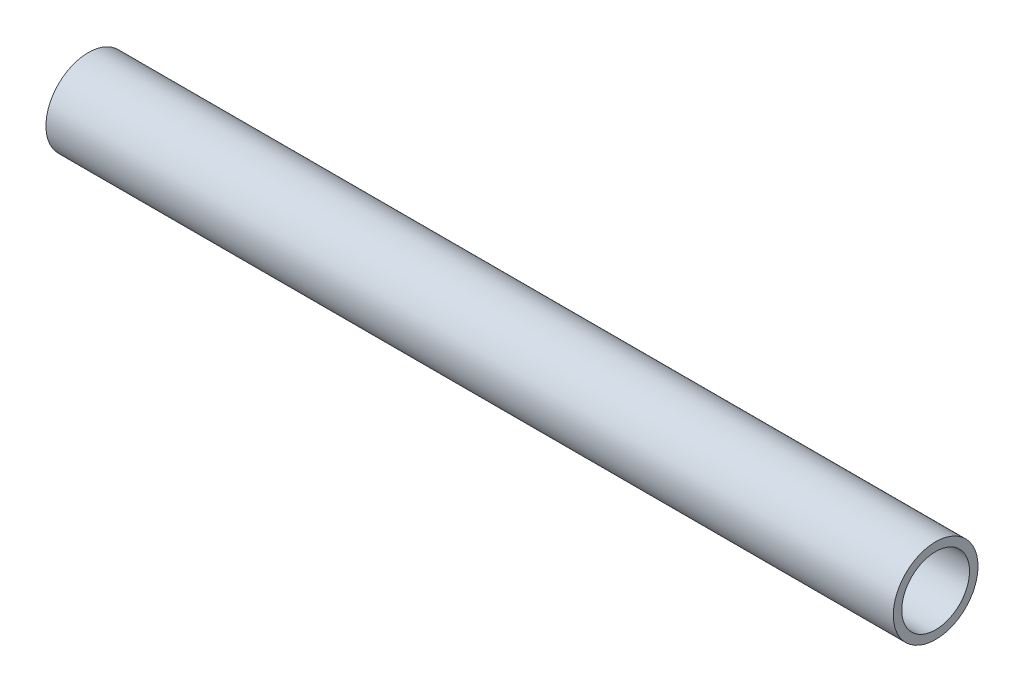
from build123d import *

# Parameters (mm, degrees)
SKETCH1_R           = 12.5
SKETCH1_R_2         = 10
BOSS_EXTRUDE1_DEPTH = 250


with BuildPart() as part:
    # Sketch1 → Boss-Extrude1 (new body)
    with BuildSketch(Plane(origin=(0, 0, 0), x_dir=(0, 0, -1), z_dir=(1, 0, 0))):
        Circle(SKETCH1_R)
        Circle(SKETCH1_R_2, mode=Mode.SUBTRACT)
    extrude(amount=BOSS_EXTRUDE1_DEPTH)


solid = part.part
